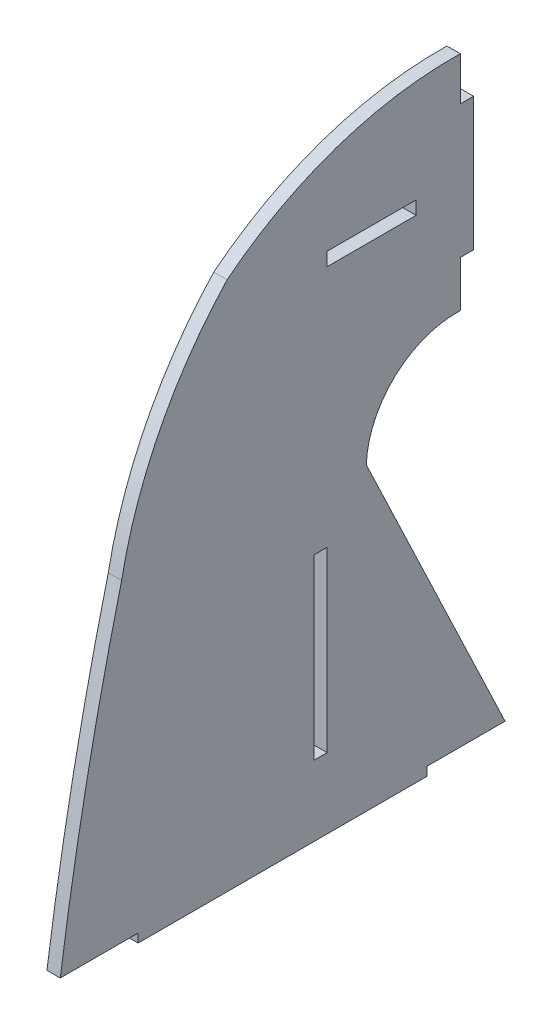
ISO-10303-21;
HEADER;
FILE_DESCRIPTION(('STEP AP214'),'2;1');
FILE_NAME('part.step','',(''),(''),'','','');
FILE_SCHEMA(('AUTOMOTIVE_DESIGN { 1 0 10303 214 1 1 1 1 }'));
ENDSEC;
DATA;
#1=APPLICATION_CONTEXT('core data for automotive mechanical design processes');
#2=APPLICATION_PROTOCOL_DEFINITION('international standard','automotive_design',2000,#1);
#3=PRODUCT_CONTEXT('',#1,'mechanical');
#4=PRODUCT('Part','Part','',(#3));
#5=PRODUCT_RELATED_PRODUCT_CATEGORY('part','',(#4));
#6=PRODUCT_DEFINITION_FORMATION('','',#4);
#7=PRODUCT_DEFINITION_CONTEXT('part definition',#1,'design');
#8=PRODUCT_DEFINITION('design','',#6,#7);
#9=PRODUCT_DEFINITION_SHAPE('','',#8);
#10=(LENGTH_UNIT() NAMED_UNIT(*) SI_UNIT(.MILLI.,.METRE.));
#11=(NAMED_UNIT(*) PLANE_ANGLE_UNIT() SI_UNIT($,.RADIAN.));
#12=(NAMED_UNIT(*) SI_UNIT($,.STERADIAN.) SOLID_ANGLE_UNIT());
#13=UNCERTAINTY_MEASURE_WITH_UNIT(LENGTH_MEASURE(1.E-05),#10,'distance_accuracy_value','');
#14=(GEOMETRIC_REPRESENTATION_CONTEXT(3) GLOBAL_UNCERTAINTY_ASSIGNED_CONTEXT((#13)) GLOBAL_UNIT_ASSIGNED_CONTEXT((#10,
#11,#12)) REPRESENTATION_CONTEXT('',''));
#15=CARTESIAN_POINT('',(0.,0.,0.));
#16=DIRECTION('',(0.,0.,1.));
#17=DIRECTION('',(1.,0.,0.));
#18=AXIS2_PLACEMENT_3D('',#15,#16,#17);
#19=CARTESIAN_POINT('',(3.,-123.619326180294,0.));
#20=DIRECTION('',(0.,-1.,0.));
#21=DIRECTION('',(0.,0.,-1.));
#22=AXIS2_PLACEMENT_3D('',#19,#20,#21);
#23=PLANE('',#22);
#24=DIRECTION('',(0.,0.,1.));
#25=VECTOR('',#24,1.);
#26=CARTESIAN_POINT('',(0.,-123.619326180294,0.));
#27=LINE('',#26,#25);
#28=CARTESIAN_POINT('',(0.,-123.619326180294,-10.));
#29=VERTEX_POINT('',#28);
#30=CARTESIAN_POINT('',(0.,-123.619326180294,-7.));
#31=VERTEX_POINT('',#30);
#32=EDGE_CURVE('E272',#29,#31,#27,.T.);
#33=ORIENTED_EDGE('',*,*,#32,.T.);
#34=DIRECTION('',(-1.,0.,0.));
#35=VECTOR('',#34,1.);
#36=CARTESIAN_POINT('',(3.,-123.619326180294,-7.));
#37=LINE('',#36,#35);
#38=CARTESIAN_POINT('',(3.,-123.619326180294,-7.));
#39=VERTEX_POINT('',#38);
#40=EDGE_CURVE('E11',#39,#31,#37,.T.);
#41=ORIENTED_EDGE('',*,*,#40,.F.);
#42=DIRECTION('',(0.,0.,1.));
#43=VECTOR('',#42,1.);
#44=CARTESIAN_POINT('',(3.,-123.619326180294,0.));
#45=LINE('',#44,#43);
#46=CARTESIAN_POINT('',(3.,-123.619326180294,-10.));
#47=VERTEX_POINT('',#46);
#48=EDGE_CURVE('E204',#47,#39,#45,.T.);
#49=ORIENTED_EDGE('',*,*,#48,.F.);
#50=DIRECTION('',(-1.,0.,0.));
#51=VECTOR('',#50,1.);
#52=CARTESIAN_POINT('',(3.,-123.619326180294,-10.));
#53=LINE('',#52,#51);
#54=EDGE_CURVE('E54',#47,#29,#53,.T.);
#55=ORIENTED_EDGE('',*,*,#54,.T.);
#56=EDGE_LOOP('',(#33,#41,#49,#55));
#57=FACE_BOUND('',#56,.T.);
#58=ADVANCED_FACE('F35',(#57),#23,.F.);
#59=CARTESIAN_POINT('',(3.,0.,-7.));
#60=DIRECTION('',(0.,0.,1.));
#61=DIRECTION('',(1.,0.,0.));
#62=AXIS2_PLACEMENT_3D('',#59,#60,#61);
#63=PLANE('',#62);
#64=DIRECTION('',(0.,1.,0.));
#65=VECTOR('',#64,1.);
#66=CARTESIAN_POINT('',(0.,0.,-7.));
#67=LINE('',#66,#65);
#68=CARTESIAN_POINT('',(0.,-83.6193261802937,-7.));
#69=VERTEX_POINT('',#68);
#70=EDGE_CURVE('E210',#31,#69,#67,.T.);
#71=ORIENTED_EDGE('',*,*,#70,.T.);
#72=DIRECTION('',(-1.,0.,0.));
#73=VECTOR('',#72,1.);
#74=CARTESIAN_POINT('',(3.,-83.6193261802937,-7.));
#75=LINE('',#74,#73);
#76=CARTESIAN_POINT('',(3.,-83.6193261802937,-7.));
#77=VERTEX_POINT('',#76);
#78=EDGE_CURVE('E45',#77,#69,#75,.T.);
#79=ORIENTED_EDGE('',*,*,#78,.F.);
#80=DIRECTION('',(0.,1.,0.));
#81=VECTOR('',#80,1.);
#82=CARTESIAN_POINT('',(3.,0.,-7.));
#83=LINE('',#82,#81);
#84=EDGE_CURVE('E198',#39,#77,#83,.T.);
#85=ORIENTED_EDGE('',*,*,#84,.F.);
#86=ORIENTED_EDGE('',*,*,#40,.T.);
#87=EDGE_LOOP('',(#71,#79,#85,#86));
#88=FACE_BOUND('',#87,.T.);
#89=ADVANCED_FACE('F209',(#88),#63,.F.);
#90=CARTESIAN_POINT('',(3.,-83.6193261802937,0.));
#91=DIRECTION('',(0.,-1.,0.));
#92=DIRECTION('',(0.,0.,-1.));
#93=AXIS2_PLACEMENT_3D('',#90,#91,#92);
#94=PLANE('',#93);
#95=DIRECTION('',(0.,0.,1.));
#96=VECTOR('',#95,1.);
#97=CARTESIAN_POINT('',(0.,-83.6193261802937,0.));
#98=LINE('',#97,#96);
#99=CARTESIAN_POINT('',(0.,-83.6193261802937,-10.));
#100=VERTEX_POINT('',#99);
#101=EDGE_CURVE('E275',#100,#69,#98,.T.);
#102=ORIENTED_EDGE('',*,*,#101,.F.);
#103=DIRECTION('',(-1.,0.,0.));
#104=VECTOR('',#103,1.);
#105=CARTESIAN_POINT('',(3.,-83.6193261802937,-10.));
#106=LINE('',#105,#104);
#107=CARTESIAN_POINT('',(3.,-83.6193261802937,-10.));
#108=VERTEX_POINT('',#107);
#109=EDGE_CURVE('E125',#108,#100,#106,.T.);
#110=ORIENTED_EDGE('',*,*,#109,.F.);
#111=DIRECTION('',(0.,0.,1.));
#112=VECTOR('',#111,1.);
#113=CARTESIAN_POINT('',(3.,-83.6193261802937,0.));
#114=LINE('',#113,#112);
#115=EDGE_CURVE('E203',#108,#77,#114,.T.);
#116=ORIENTED_EDGE('',*,*,#115,.T.);
#117=ORIENTED_EDGE('',*,*,#78,.T.);
#118=EDGE_LOOP('',(#102,#110,#116,#117));
#119=FACE_BOUND('',#118,.T.);
#120=ADVANCED_FACE('F214',(#119),#94,.T.);
#121=CARTESIAN_POINT('',(3.,-26.,0.));
#122=DIRECTION('',(0.,1.,0.));
#123=DIRECTION('',(0.,0.,1.));
#124=AXIS2_PLACEMENT_3D('',#121,#122,#123);
#125=PLANE('',#124);
#126=DIRECTION('',(0.,0.,-1.));
#127=VECTOR('',#126,1.);
#128=CARTESIAN_POINT('',(0.,-26.,0.));
#129=LINE('',#128,#127);
#130=CARTESIAN_POINT('',(0.,-26.,-10.));
#131=VERTEX_POINT('',#130);
#132=CARTESIAN_POINT('',(0.,-26.,-30.));
#133=VERTEX_POINT('',#132);
#134=EDGE_CURVE('E260',#131,#133,#129,.T.);
#135=ORIENTED_EDGE('',*,*,#134,.T.);
#136=DIRECTION('',(-1.,0.,0.));
#137=VECTOR('',#136,1.);
#138=CARTESIAN_POINT('',(3.,-26.,-30.));
#139=LINE('',#138,#137);
#140=CARTESIAN_POINT('',(3.,-26.,-30.));
#141=VERTEX_POINT('',#140);
#142=EDGE_CURVE('E282',#141,#133,#139,.T.);
#143=ORIENTED_EDGE('',*,*,#142,.F.);
#144=DIRECTION('',(0.,0.,-1.));
#145=VECTOR('',#144,1.);
#146=CARTESIAN_POINT('',(3.,-26.,0.));
#147=LINE('',#146,#145);
#148=CARTESIAN_POINT('',(3.,-26.,-10.));
#149=VERTEX_POINT('',#148);
#150=EDGE_CURVE('E425',#149,#141,#147,.T.);
#151=ORIENTED_EDGE('',*,*,#150,.F.);
#152=DIRECTION('',(-1.,0.,0.));
#153=VECTOR('',#152,1.);
#154=CARTESIAN_POINT('',(3.,-26.,-10.));
#155=LINE('',#154,#153);
#156=EDGE_CURVE('E284',#149,#131,#155,.T.);
#157=ORIENTED_EDGE('',*,*,#156,.T.);
#158=EDGE_LOOP('',(#135,#143,#151,#157));
#159=FACE_BOUND('',#158,.T.);
#160=ADVANCED_FACE('F450',(#159),#125,.F.);
#161=CARTESIAN_POINT('',(3.,0.,-30.));
#162=DIRECTION('',(0.,0.,-1.));
#163=DIRECTION('',(-1.,0.,0.));
#164=AXIS2_PLACEMENT_3D('',#161,#162,#163);
#165=PLANE('',#164);
#166=DIRECTION('',(0.,-1.,0.));
#167=VECTOR('',#166,1.);
#168=CARTESIAN_POINT('',(0.,0.,-30.));
#169=LINE('',#168,#167);
#170=CARTESIAN_POINT('',(0.,-29.,-30.));
#171=VERTEX_POINT('',#170);
#172=EDGE_CURVE('E263',#133,#171,#169,.T.);
#173=ORIENTED_EDGE('',*,*,#172,.T.);
#174=DIRECTION('',(-1.,0.,0.));
#175=VECTOR('',#174,1.);
#176=CARTESIAN_POINT('',(3.,-29.,-30.));
#177=LINE('',#176,#175);
#178=CARTESIAN_POINT('',(3.,-29.,-30.));
#179=VERTEX_POINT('',#178);
#180=EDGE_CURVE('E288',#179,#171,#177,.T.);
#181=ORIENTED_EDGE('',*,*,#180,.F.);
#182=DIRECTION('',(0.,-1.,0.));
#183=VECTOR('',#182,1.);
#184=CARTESIAN_POINT('',(3.,0.,-30.));
#185=LINE('',#184,#183);
#186=EDGE_CURVE('E428',#141,#179,#185,.T.);
#187=ORIENTED_EDGE('',*,*,#186,.F.);
#188=ORIENTED_EDGE('',*,*,#142,.T.);
#189=EDGE_LOOP('',(#173,#181,#187,#188));
#190=FACE_BOUND('',#189,.T.);
#191=ADVANCED_FACE('F452',(#190),#165,.F.);
#192=CARTESIAN_POINT('',(3.,-29.,0.));
#193=DIRECTION('',(0.,1.,0.));
#194=DIRECTION('',(0.,0.,1.));
#195=AXIS2_PLACEMENT_3D('',#192,#193,#194);
#196=PLANE('',#195);
#197=DIRECTION('',(0.,0.,-1.));
#198=VECTOR('',#197,1.);
#199=CARTESIAN_POINT('',(0.,-29.,0.));
#200=LINE('',#199,#198);
#201=CARTESIAN_POINT('',(0.,-29.,-10.));
#202=VERTEX_POINT('',#201);
#203=EDGE_CURVE('E266',#202,#171,#200,.T.);
#204=ORIENTED_EDGE('',*,*,#203,.F.);
#205=DIRECTION('',(-1.,0.,0.));
#206=VECTOR('',#205,1.);
#207=CARTESIAN_POINT('',(3.,-29.,-10.));
#208=LINE('',#207,#206);
#209=CARTESIAN_POINT('',(3.,-29.,-10.));
#210=VERTEX_POINT('',#209);
#211=EDGE_CURVE('E286',#210,#202,#208,.T.);
#212=ORIENTED_EDGE('',*,*,#211,.F.);
#213=DIRECTION('',(0.,0.,-1.));
#214=VECTOR('',#213,1.);
#215=CARTESIAN_POINT('',(3.,-29.,0.));
#216=LINE('',#215,#214);
#217=EDGE_CURVE('E430',#210,#179,#216,.T.);
#218=ORIENTED_EDGE('',*,*,#217,.T.);
#219=ORIENTED_EDGE('',*,*,#180,.T.);
#220=EDGE_LOOP('',(#204,#212,#218,#219));
#221=FACE_BOUND('',#220,.T.);
#222=ADVANCED_FACE('F446',(#221),#196,.T.);
#223=CARTESIAN_POINT('',(3.,-72.8176423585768,-39.0635127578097));
#224=DIRECTION('',(-1.,0.,0.));
#225=DIRECTION('',(0.,0.,1.));
#226=AXIS2_PLACEMENT_3D('',#223,#224,#225);
#227=CYLINDRICAL_SURFACE('',#226,20.2971132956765);
#228=CARTESIAN_POINT('',(0.,-72.8176423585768,-39.0635127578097));
#229=DIRECTION('',(1.,0.,0.));
#230=DIRECTION('',(0.,0.,-1.));
#231=AXIS2_PLACEMENT_3D('',#228,#229,#230);
#232=CIRCLE('',#231,20.2971132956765);
#233=CARTESIAN_POINT('',(0.,-52.5391449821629,-39.9326228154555));
#234=VERTEX_POINT('',#233);
#235=CARTESIAN_POINT('',(0.,-71.9485323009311,-18.7850153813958));
#236=VERTEX_POINT('',#235);
#237=EDGE_CURVE('E221',#234,#236,#232,.T.);
#238=ORIENTED_EDGE('',*,*,#237,.F.);
#239=DIRECTION('',(-1.,0.,0.));
#240=VECTOR('',#239,1.);
#241=CARTESIAN_POINT('',(3.,-52.5391449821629,-39.9326228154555));
#242=LINE('',#241,#240);
#243=CARTESIAN_POINT('',(3.,-52.5391449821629,-39.9326228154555));
#244=VERTEX_POINT('',#243);
#245=EDGE_CURVE('E39',#244,#234,#242,.T.);
#246=ORIENTED_EDGE('',*,*,#245,.F.);
#247=CARTESIAN_POINT('',(3.,-72.8176423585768,-39.0635127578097));
#248=DIRECTION('',(1.,0.,0.));
#249=DIRECTION('',(0.,0.,-1.));
#250=AXIS2_PLACEMENT_3D('',#247,#248,#249);
#251=CIRCLE('',#250,20.2971132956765);
#252=CARTESIAN_POINT('',(3.,-71.9485323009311,-18.7850153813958));
#253=VERTEX_POINT('',#252);
#254=EDGE_CURVE('E280',#244,#253,#251,.T.);
#255=ORIENTED_EDGE('',*,*,#254,.T.);
#256=DIRECTION('',(-1.,0.,0.));
#257=VECTOR('',#256,1.);
#258=CARTESIAN_POINT('',(3.,-71.9485323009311,-18.7850153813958));
#259=LINE('',#258,#257);
#260=EDGE_CURVE('E217',#253,#236,#259,.T.);
#261=ORIENTED_EDGE('',*,*,#260,.T.);
#262=EDGE_LOOP('',(#238,#246,#255,#261));
#263=FACE_BOUND('',#262,.T.);
#264=ADVANCED_FACE('F37',(#263),#227,.F.);
#265=CARTESIAN_POINT('',(3.,0.,-39.9326228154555));
#266=DIRECTION('',(0.,0.,1.));
#267=DIRECTION('',(1.,0.,0.));
#268=AXIS2_PLACEMENT_3D('',#265,#266,#267);
#269=PLANE('',#268);
#270=DIRECTION('',(0.,1.,0.));
#271=VECTOR('',#270,1.);
#272=CARTESIAN_POINT('',(0.,0.,-39.9326228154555));
#273=LINE('',#272,#271);
#274=CARTESIAN_POINT('',(0.,-42.1755134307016,-39.9326228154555));
#275=VERTEX_POINT('',#274);
#276=EDGE_CURVE('E224',#234,#275,#273,.T.);
#277=ORIENTED_EDGE('',*,*,#276,.T.);
#278=DIRECTION('',(-1.,0.,0.));
#279=VECTOR('',#278,1.);
#280=CARTESIAN_POINT('',(3.,-42.1755134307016,-39.9326228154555));
#281=LINE('',#280,#279);
#282=CARTESIAN_POINT('',(3.,-42.1755134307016,-39.9326228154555));
#283=VERTEX_POINT('',#282);
#284=EDGE_CURVE('E321',#283,#275,#281,.T.);
#285=ORIENTED_EDGE('',*,*,#284,.F.);
#286=DIRECTION('',(0.,1.,0.));
#287=VECTOR('',#286,1.);
#288=CARTESIAN_POINT('',(3.,0.,-39.9326228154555));
#289=LINE('',#288,#287);
#290=EDGE_CURVE('E330',#244,#283,#289,.T.);
#291=ORIENTED_EDGE('',*,*,#290,.F.);
#292=ORIENTED_EDGE('',*,*,#245,.T.);
#293=EDGE_LOOP('',(#277,#285,#291,#292));
#294=FACE_BOUND('',#293,.T.);
#295=ADVANCED_FACE('F329',(#294),#269,.F.);
#296=CARTESIAN_POINT('',(3.,-42.1755134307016,0.));
#297=DIRECTION('',(0.,1.,0.));
#298=DIRECTION('',(0.,0.,1.));
#299=AXIS2_PLACEMENT_3D('',#296,#297,#298);
#300=PLANE('',#299);
#301=DIRECTION('',(0.,0.,-1.));
#302=VECTOR('',#301,1.);
#303=CARTESIAN_POINT('',(0.,-42.1755134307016,0.));
#304=LINE('',#303,#302);
#305=CARTESIAN_POINT('',(0.,-42.1755134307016,-42.9326228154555));
#306=VERTEX_POINT('',#305);
#307=EDGE_CURVE('E226',#275,#306,#304,.T.);
#308=ORIENTED_EDGE('',*,*,#307,.T.);
#309=DIRECTION('',(-1.,0.,0.));
#310=VECTOR('',#309,1.);
#311=CARTESIAN_POINT('',(3.,-42.1755134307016,-42.9326228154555));
#312=LINE('',#311,#310);
#313=CARTESIAN_POINT('',(3.,-42.1755134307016,-42.9326228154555));
#314=VERTEX_POINT('',#313);
#315=EDGE_CURVE('E319',#314,#306,#312,.T.);
#316=ORIENTED_EDGE('',*,*,#315,.F.);
#317=DIRECTION('',(0.,0.,-1.));
#318=VECTOR('',#317,1.);
#319=CARTESIAN_POINT('',(3.,-42.1755134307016,0.));
#320=LINE('',#319,#318);
#321=EDGE_CURVE('E403',#283,#314,#320,.T.);
#322=ORIENTED_EDGE('',*,*,#321,.F.);
#323=ORIENTED_EDGE('',*,*,#284,.T.);
#324=EDGE_LOOP('',(#308,#316,#322,#323));
#325=FACE_BOUND('',#324,.T.);
#326=ADVANCED_FACE('F402',(#325),#300,.F.);
#327=CARTESIAN_POINT('',(3.,0.,-42.9326228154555));
#328=DIRECTION('',(0.,0.,1.));
#329=DIRECTION('',(1.,0.,0.));
#330=AXIS2_PLACEMENT_3D('',#327,#328,#329);
#331=PLANE('',#330);
#332=DIRECTION('',(0.,1.,0.));
#333=VECTOR('',#332,1.);
#334=CARTESIAN_POINT('',(0.,0.,-42.9326228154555));
#335=LINE('',#334,#333);
#336=CARTESIAN_POINT('',(0.,-12.2755134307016,-42.9326228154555));
#337=VERTEX_POINT('',#336);
#338=EDGE_CURVE('E228',#306,#337,#335,.T.);
#339=ORIENTED_EDGE('',*,*,#338,.T.);
#340=DIRECTION('',(-1.,0.,0.));
#341=VECTOR('',#340,1.);
#342=CARTESIAN_POINT('',(3.,-12.2755134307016,-42.9326228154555));
#343=LINE('',#342,#341);
#344=CARTESIAN_POINT('',(3.,-12.2755134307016,-42.9326228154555));
#345=VERTEX_POINT('',#344);
#346=EDGE_CURVE('E317',#345,#337,#343,.T.);
#347=ORIENTED_EDGE('',*,*,#346,.F.);
#348=DIRECTION('',(0.,1.,0.));
#349=VECTOR('',#348,1.);
#350=CARTESIAN_POINT('',(3.,0.,-42.9326228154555));
#351=LINE('',#350,#349);
#352=EDGE_CURVE('E401',#314,#345,#351,.T.);
#353=ORIENTED_EDGE('',*,*,#352,.F.);
#354=ORIENTED_EDGE('',*,*,#315,.T.);
#355=EDGE_LOOP('',(#339,#347,#353,#354));
#356=FACE_BOUND('',#355,.T.);
#357=ADVANCED_FACE('F399',(#356),#331,.F.);
#358=CARTESIAN_POINT('',(3.,-12.2755134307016,0.));
#359=DIRECTION('',(0.,1.,0.));
#360=DIRECTION('',(0.,0.,1.));
#361=AXIS2_PLACEMENT_3D('',#358,#359,#360);
#362=PLANE('',#361);
#363=DIRECTION('',(0.,0.,-1.));
#364=VECTOR('',#363,1.);
#365=CARTESIAN_POINT('',(0.,-12.2755134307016,0.));
#366=LINE('',#365,#364);
#367=CARTESIAN_POINT('',(0.,-12.2755134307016,-39.9326228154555));
#368=VERTEX_POINT('',#367);
#369=EDGE_CURVE('E231',#368,#337,#366,.T.);
#370=ORIENTED_EDGE('',*,*,#369,.F.);
#371=DIRECTION('',(-1.,0.,0.));
#372=VECTOR('',#371,1.);
#373=CARTESIAN_POINT('',(3.,-12.2755134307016,-39.9326228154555));
#374=LINE('',#373,#372);
#375=CARTESIAN_POINT('',(3.,-12.2755134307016,-39.9326228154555));
#376=VERTEX_POINT('',#375);
#377=EDGE_CURVE('E315',#376,#368,#374,.T.);
#378=ORIENTED_EDGE('',*,*,#377,.F.);
#379=DIRECTION('',(0.,0.,-1.));
#380=VECTOR('',#379,1.);
#381=CARTESIAN_POINT('',(3.,-12.2755134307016,0.));
#382=LINE('',#381,#380);
#383=EDGE_CURVE('E396',#376,#345,#382,.T.);
#384=ORIENTED_EDGE('',*,*,#383,.T.);
#385=ORIENTED_EDGE('',*,*,#346,.T.);
#386=EDGE_LOOP('',(#370,#378,#384,#385));
#387=FACE_BOUND('',#386,.T.);
#388=ADVANCED_FACE('F391',(#387),#362,.T.);
#389=CARTESIAN_POINT('',(3.,0.,-39.9326228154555));
#390=DIRECTION('',(0.,0.,1.));
#391=DIRECTION('',(0.,-1.,0.));
#392=AXIS2_PLACEMENT_3D('',#389,#390,#391);
#393=PLANE('',#392);
#394=DIRECTION('',(0.,1.,0.));
#395=VECTOR('',#394,1.);
#396=CARTESIAN_POINT('',(0.,0.,-39.9326228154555));
#397=LINE('',#396,#395);
#398=CARTESIAN_POINT('',(0.,-2.50000000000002,-39.9326228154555));
#399=VERTEX_POINT('',#398);
#400=EDGE_CURVE('E234',#368,#399,#397,.T.);
#401=ORIENTED_EDGE('',*,*,#400,.T.);
#402=DIRECTION('',(-1.,0.,0.));
#403=VECTOR('',#402,1.);
#404=CARTESIAN_POINT('',(3.,-2.50000000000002,-39.9326228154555));
#405=LINE('',#404,#403);
#406=CARTESIAN_POINT('',(3.,-2.50000000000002,-39.9326228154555));
#407=VERTEX_POINT('',#406);
#408=EDGE_CURVE('E312',#407,#399,#405,.T.);
#409=ORIENTED_EDGE('',*,*,#408,.F.);
#410=DIRECTION('',(0.,1.,0.));
#411=VECTOR('',#410,1.);
#412=CARTESIAN_POINT('',(3.,0.,-39.9326228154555));
#413=LINE('',#412,#411);
#414=EDGE_CURVE('E411',#376,#407,#413,.T.);
#415=ORIENTED_EDGE('',*,*,#414,.F.);
#416=ORIENTED_EDGE('',*,*,#377,.T.);
#417=EDGE_LOOP('',(#401,#409,#415,#416));
#418=FACE_BOUND('',#417,.T.);
#419=ADVANCED_FACE('F495',(#418),#393,.F.);
#420=CARTESIAN_POINT('',(3.,-84.19117621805,-38.4282214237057));
#421=DIRECTION('',(-1.,0.,0.));
#422=DIRECTION('',(0.,0.,1.));
#423=AXIS2_PLACEMENT_3D('',#420,#421,#422);
#424=CYLINDRICAL_SURFACE('',#423,81.7050273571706);
#425=CARTESIAN_POINT('',(0.,-84.19117621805,-38.4282214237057));
#426=DIRECTION('',(1.,0.,0.));
#427=DIRECTION('',(0.,0.,-1.));
#428=AXIS2_PLACEMENT_3D('',#425,#426,#427);
#429=CIRCLE('',#428,81.7050273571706);
#430=CARTESIAN_POINT('',(0.,-20.2909224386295,12.4880732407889));
#431=VERTEX_POINT('',#430);
#432=EDGE_CURVE('E236',#399,#431,#429,.T.);
#433=ORIENTED_EDGE('',*,*,#432,.T.);
#434=DIRECTION('',(-1.,0.,0.));
#435=VECTOR('',#434,1.);
#436=CARTESIAN_POINT('',(3.,-20.2909224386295,12.4880732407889));
#437=LINE('',#436,#435);
#438=CARTESIAN_POINT('',(3.,-20.2909224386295,12.4880732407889));
#439=VERTEX_POINT('',#438);
#440=EDGE_CURVE('E310',#439,#431,#437,.T.);
#441=ORIENTED_EDGE('',*,*,#440,.F.);
#442=CARTESIAN_POINT('',(3.,-84.19117621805,-38.4282214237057));
#443=DIRECTION('',(1.,0.,0.));
#444=DIRECTION('',(0.,0.,-1.));
#445=AXIS2_PLACEMENT_3D('',#442,#443,#444);
#446=CIRCLE('',#445,81.7050273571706);
#447=EDGE_CURVE('E413',#407,#439,#446,.T.);
#448=ORIENTED_EDGE('',*,*,#447,.F.);
#449=ORIENTED_EDGE('',*,*,#408,.T.);
#450=EDGE_LOOP('',(#433,#441,#448,#449));
#451=FACE_BOUND('',#450,.T.);
#452=ADVANCED_FACE('F385',(#451),#424,.T.);
#453=CARTESIAN_POINT('',(3.,-85.0415719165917,-57.1585149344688));
#454=DIRECTION('',(-1.,0.,0.));
#455=DIRECTION('',(0.,0.,1.));
#456=AXIS2_PLACEMENT_3D('',#453,#454,#455);
#457=CYLINDRICAL_SURFACE('',#456,95.0962346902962);
#458=CARTESIAN_POINT('',(0.,-85.0415719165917,-57.1585149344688));
#459=DIRECTION('',(1.,0.,0.));
#460=DIRECTION('',(0.,0.,-1.));
#461=AXIS2_PLACEMENT_3D('',#458,#459,#460);
#462=CIRCLE('',#461,95.0962346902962);
#463=CARTESIAN_POINT('',(0.,-67.0138741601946,36.213300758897));
#464=VERTEX_POINT('',#463);
#465=EDGE_CURVE('E239',#464,#431,#462,.F.);
#466=ORIENTED_EDGE('',*,*,#465,.F.);
#467=DIRECTION('',(-1.,0.,0.));
#468=VECTOR('',#467,1.);
#469=CARTESIAN_POINT('',(3.,-67.0138741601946,36.213300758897));
#470=LINE('',#469,#468);
#471=CARTESIAN_POINT('',(3.,-67.0138741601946,36.213300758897));
#472=VERTEX_POINT('',#471);
#473=EDGE_CURVE('E308',#472,#464,#470,.T.);
#474=ORIENTED_EDGE('',*,*,#473,.F.);
#475=CARTESIAN_POINT('',(3.,-85.0415719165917,-57.1585149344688));
#476=DIRECTION('',(1.,0.,0.));
#477=DIRECTION('',(0.,0.,-1.));
#478=AXIS2_PLACEMENT_3D('',#475,#476,#477);
#479=CIRCLE('',#478,95.0962346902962);
#480=EDGE_CURVE('E382',#472,#439,#479,.F.);
#481=ORIENTED_EDGE('',*,*,#480,.T.);
#482=ORIENTED_EDGE('',*,*,#440,.T.);
#483=EDGE_LOOP('',(#466,#474,#481,#482));
#484=FACE_BOUND('',#483,.T.);
#485=ADVANCED_FACE('F379',(#484),#457,.T.);
#486=CARTESIAN_POINT('',(3.,-232.588255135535,-623.227584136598));
#487=DIRECTION('',(-1.,0.,0.));
#488=DIRECTION('',(0.,0.,1.));
#489=AXIS2_PLACEMENT_3D('',#486,#487,#488);
#490=CYLINDRICAL_SURFACE('',#489,679.909667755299);
#491=CARTESIAN_POINT('',(0.,-232.588255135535,-623.227584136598));
#492=DIRECTION('',(1.,0.,0.));
#493=DIRECTION('',(0.,0.,-1.));
#494=AXIS2_PLACEMENT_3D('',#491,#492,#493);
#495=CIRCLE('',#494,679.909667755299);
#496=CARTESIAN_POINT('',(0.,-137.5,50.));
#497=VERTEX_POINT('',#496);
#498=EDGE_CURVE('E242',#464,#497,#495,.T.);
#499=ORIENTED_EDGE('',*,*,#498,.T.);
#500=DIRECTION('',(-1.,0.,0.));
#501=VECTOR('',#500,1.);
#502=CARTESIAN_POINT('',(3.,-137.5,50.));
#503=LINE('',#502,#501);
#504=CARTESIAN_POINT('',(3.,-137.5,50.));
#505=VERTEX_POINT('',#504);
#506=EDGE_CURVE('E305',#505,#497,#503,.T.);
#507=ORIENTED_EDGE('',*,*,#506,.F.);
#508=CARTESIAN_POINT('',(3.,-232.588255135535,-623.227584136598));
#509=DIRECTION('',(1.,0.,0.));
#510=DIRECTION('',(0.,0.,-1.));
#511=AXIS2_PLACEMENT_3D('',#508,#509,#510);
#512=CIRCLE('',#511,679.909667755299);
#513=EDGE_CURVE('E374',#472,#505,#512,.T.);
#514=ORIENTED_EDGE('',*,*,#513,.F.);
#515=ORIENTED_EDGE('',*,*,#473,.T.);
#516=EDGE_LOOP('',(#499,#507,#514,#515));
#517=FACE_BOUND('',#516,.T.);
#518=ADVANCED_FACE('F373',(#517),#490,.T.);
#519=CARTESIAN_POINT('',(3.,-137.5,0.));
#520=DIRECTION('',(0.,1.,0.));
#521=DIRECTION('',(0.,0.,1.));
#522=AXIS2_PLACEMENT_3D('',#519,#520,#521);
#523=PLANE('',#522);
#524=DIRECTION('',(0.,0.,-1.));
#525=VECTOR('',#524,1.);
#526=CARTESIAN_POINT('',(0.,-137.5,0.));
#527=LINE('',#526,#525);
#528=CARTESIAN_POINT('',(0.,-137.5,32.5));
#529=VERTEX_POINT('',#528);
#530=EDGE_CURVE('E244',#497,#529,#527,.T.);
#531=ORIENTED_EDGE('',*,*,#530,.T.);
#532=DIRECTION('',(-1.,0.,0.));
#533=VECTOR('',#532,1.);
#534=CARTESIAN_POINT('',(3.,-137.5,32.5));
#535=LINE('',#534,#533);
#536=CARTESIAN_POINT('',(3.,-137.5,32.5));
#537=VERTEX_POINT('',#536);
#538=EDGE_CURVE('E302',#537,#529,#535,.T.);
#539=ORIENTED_EDGE('',*,*,#538,.F.);
#540=DIRECTION('',(0.,0.,-1.));
#541=VECTOR('',#540,1.);
#542=CARTESIAN_POINT('',(3.,-137.5,0.));
#543=LINE('',#542,#541);
#544=EDGE_CURVE('E369',#505,#537,#543,.T.);
#545=ORIENTED_EDGE('',*,*,#544,.F.);
#546=ORIENTED_EDGE('',*,*,#506,.T.);
#547=EDGE_LOOP('',(#531,#539,#545,#546));
#548=FACE_BOUND('',#547,.T.);
#549=ADVANCED_FACE('F368',(#548),#523,.F.);
#550=CARTESIAN_POINT('',(3.,1.15308836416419E-13,32.4999999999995));
#551=DIRECTION('',(0.,0.,-1.));
#552=DIRECTION('',(0.,1.,0.));
#553=AXIS2_PLACEMENT_3D('',#550,#551,#552);
#554=PLANE('',#553);
#555=DIRECTION('',(0.,-1.,0.));
#556=VECTOR('',#555,1.);
#557=CARTESIAN_POINT('',(0.,1.15308836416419E-13,32.4999999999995));
#558=LINE('',#557,#556);
#559=CARTESIAN_POINT('',(0.,-139.455739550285,32.5));
#560=VERTEX_POINT('',#559);
#561=EDGE_CURVE('E246',#529,#560,#558,.T.);
#562=ORIENTED_EDGE('',*,*,#561,.T.);
#563=DIRECTION('',(-1.,0.,0.));
#564=VECTOR('',#563,1.);
#565=CARTESIAN_POINT('',(3.,-139.455739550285,32.5));
#566=LINE('',#565,#564);
#567=CARTESIAN_POINT('',(3.,-139.455739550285,32.5));
#568=VERTEX_POINT('',#567);
#569=EDGE_CURVE('E299',#568,#560,#566,.T.);
#570=ORIENTED_EDGE('',*,*,#569,.F.);
#571=DIRECTION('',(0.,-1.,0.));
#572=VECTOR('',#571,1.);
#573=CARTESIAN_POINT('',(3.,1.15308836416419E-13,32.4999999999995));
#574=LINE('',#573,#572);
#575=EDGE_CURVE('E365',#537,#568,#574,.T.);
#576=ORIENTED_EDGE('',*,*,#575,.F.);
#577=ORIENTED_EDGE('',*,*,#538,.T.);
#578=EDGE_LOOP('',(#562,#570,#576,#577));
#579=FACE_BOUND('',#578,.T.);
#580=ADVANCED_FACE('F362',(#579),#554,.F.);
#581=CARTESIAN_POINT('',(3.,-139.455739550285,0.));
#582=DIRECTION('',(0.,1.,0.));
#583=DIRECTION('',(0.,0.,1.));
#584=AXIS2_PLACEMENT_3D('',#581,#582,#583);
#585=PLANE('',#584);
#586=DIRECTION('',(0.,0.,-1.));
#587=VECTOR('',#586,1.);
#588=CARTESIAN_POINT('',(0.,-139.455739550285,0.));
#589=LINE('',#588,#587);
#590=CARTESIAN_POINT('',(0.,-139.455739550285,-32.5));
#591=VERTEX_POINT('',#590);
#592=EDGE_CURVE('E248',#560,#591,#589,.T.);
#593=ORIENTED_EDGE('',*,*,#592,.T.);
#594=DIRECTION('',(-1.,0.,0.));
#595=VECTOR('',#594,1.);
#596=CARTESIAN_POINT('',(3.,-139.455739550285,-32.5));
#597=LINE('',#596,#595);
#598=CARTESIAN_POINT('',(3.,-139.455739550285,-32.5));
#599=VERTEX_POINT('',#598);
#600=EDGE_CURVE('E297',#599,#591,#597,.T.);
#601=ORIENTED_EDGE('',*,*,#600,.F.);
#602=DIRECTION('',(0.,0.,-1.));
#603=VECTOR('',#602,1.);
#604=CARTESIAN_POINT('',(3.,-139.455739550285,0.));
#605=LINE('',#604,#603);
#606=EDGE_CURVE('E419',#568,#599,#605,.T.);
#607=ORIENTED_EDGE('',*,*,#606,.F.);
#608=ORIENTED_EDGE('',*,*,#569,.T.);
#609=EDGE_LOOP('',(#593,#601,#607,#608));
#610=FACE_BOUND('',#609,.T.);
#611=ADVANCED_FACE('F356',(#610),#585,.F.);
#612=CARTESIAN_POINT('',(3.,0.,-32.5));
#613=DIRECTION('',(0.,0.,-1.));
#614=DIRECTION('',(-1.,0.,0.));
#615=AXIS2_PLACEMENT_3D('',#612,#613,#614);
#616=PLANE('',#615);
#617=DIRECTION('',(0.,-1.,0.));
#618=VECTOR('',#617,1.);
#619=CARTESIAN_POINT('',(0.,0.,-32.5));
#620=LINE('',#619,#618);
#621=CARTESIAN_POINT('',(0.,-137.5,-32.5));
#622=VERTEX_POINT('',#621);
#623=EDGE_CURVE('E251',#622,#591,#620,.T.);
#624=ORIENTED_EDGE('',*,*,#623,.F.);
#625=DIRECTION('',(-1.,0.,0.));
#626=VECTOR('',#625,1.);
#627=CARTESIAN_POINT('',(3.,-137.5,-32.5));
#628=LINE('',#627,#626);
#629=CARTESIAN_POINT('',(3.,-137.5,-32.5));
#630=VERTEX_POINT('',#629);
#631=EDGE_CURVE('E295',#630,#622,#628,.T.);
#632=ORIENTED_EDGE('',*,*,#631,.F.);
#633=DIRECTION('',(0.,-1.,0.));
#634=VECTOR('',#633,1.);
#635=CARTESIAN_POINT('',(3.,0.,-32.5));
#636=LINE('',#635,#634);
#637=EDGE_CURVE('E353',#630,#599,#636,.T.);
#638=ORIENTED_EDGE('',*,*,#637,.T.);
#639=ORIENTED_EDGE('',*,*,#600,.T.);
#640=EDGE_LOOP('',(#624,#632,#638,#639));
#641=FACE_BOUND('',#640,.T.);
#642=ADVANCED_FACE('F348',(#641),#616,.T.);
#643=CARTESIAN_POINT('',(3.,-137.5,0.));
#644=DIRECTION('',(0.,1.,0.));
#645=DIRECTION('',(0.,0.,1.));
#646=AXIS2_PLACEMENT_3D('',#643,#644,#645);
#647=PLANE('',#646);
#648=DIRECTION('',(0.,0.,-1.));
#649=VECTOR('',#648,1.);
#650=CARTESIAN_POINT('',(0.,-137.5,0.));
#651=LINE('',#650,#649);
#652=CARTESIAN_POINT('',(0.,-137.5,-50.));
#653=VERTEX_POINT('',#652);
#654=EDGE_CURVE('E254',#622,#653,#651,.T.);
#655=ORIENTED_EDGE('',*,*,#654,.T.);
#656=DIRECTION('',(-1.,0.,0.));
#657=VECTOR('',#656,1.);
#658=CARTESIAN_POINT('',(3.,-137.5,-50.));
#659=LINE('',#658,#657);
#660=CARTESIAN_POINT('',(3.,-137.5,-50.));
#661=VERTEX_POINT('',#660);
#662=EDGE_CURVE('E293',#661,#653,#659,.T.);
#663=ORIENTED_EDGE('',*,*,#662,.F.);
#664=DIRECTION('',(0.,0.,-1.));
#665=VECTOR('',#664,1.);
#666=CARTESIAN_POINT('',(3.,-137.5,0.));
#667=LINE('',#666,#665);
#668=EDGE_CURVE('E422',#630,#661,#667,.T.);
#669=ORIENTED_EDGE('',*,*,#668,.F.);
#670=ORIENTED_EDGE('',*,*,#631,.T.);
#671=EDGE_LOOP('',(#655,#663,#669,#670));
#672=FACE_BOUND('',#671,.T.);
#673=ADVANCED_FACE('F470',(#672),#647,.F.);
#674=CARTESIAN_POINT('',(3.,0.,-10.));
#675=DIRECTION('',(0.,0.,-1.));
#676=DIRECTION('',(-1.,0.,0.));
#677=AXIS2_PLACEMENT_3D('',#674,#675,#676);
#678=PLANE('',#677);
#679=DIRECTION('',(0.,-1.,0.));
#680=VECTOR('',#679,1.);
#681=CARTESIAN_POINT('',(0.,0.,-10.));
#682=LINE('',#681,#680);
#683=EDGE_CURVE('E269',#131,#202,#682,.T.);
#684=ORIENTED_EDGE('',*,*,#683,.F.);
#685=ORIENTED_EDGE('',*,*,#156,.F.);
#686=DIRECTION('',(0.,-1.,0.));
#687=VECTOR('',#686,1.);
#688=CARTESIAN_POINT('',(3.,0.,-10.));
#689=LINE('',#688,#687);
#690=EDGE_CURVE('E433',#149,#210,#689,.T.);
#691=ORIENTED_EDGE('',*,*,#690,.T.);
#692=ORIENTED_EDGE('',*,*,#211,.T.);
#693=EDGE_LOOP('',(#684,#685,#691,#692));
#694=FACE_BOUND('',#693,.T.);
#695=ADVANCED_FACE('F438',(#694),#678,.T.);
#696=CARTESIAN_POINT('',(3.,-6.00739371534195,12.6155268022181));
#697=DIRECTION('',(0.,0.429933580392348,-0.90286051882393));
#698=DIRECTION('',(0.,0.90286051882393,0.429933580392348));
#699=AXIS2_PLACEMENT_3D('',#696,#697,#698);
#700=PLANE('',#699);
#701=DIRECTION('',(0.,-0.90286051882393,-0.429933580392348));
#702=VECTOR('',#701,1.);
#703=CARTESIAN_POINT('',(0.,-6.00739371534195,12.6155268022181));
#704=LINE('',#703,#702);
#705=EDGE_CURVE('E257',#236,#653,#704,.T.);
#706=ORIENTED_EDGE('',*,*,#705,.F.);
#707=ORIENTED_EDGE('',*,*,#260,.F.);
#708=DIRECTION('',(0.,-0.90286051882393,-0.429933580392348));
#709=VECTOR('',#708,1.);
#710=CARTESIAN_POINT('',(3.,-6.00739371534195,12.6155268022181));
#711=LINE('',#710,#709);
#712=EDGE_CURVE('E341',#253,#661,#711,.T.);
#713=ORIENTED_EDGE('',*,*,#712,.T.);
#714=ORIENTED_EDGE('',*,*,#662,.T.);
#715=EDGE_LOOP('',(#706,#707,#713,#714));
#716=FACE_BOUND('',#715,.T.);
#717=ADVANCED_FACE('F340',(#716),#700,.T.);
#718=CARTESIAN_POINT('',(3.,0.,-10.));
#719=DIRECTION('',(0.,0.,1.));
#720=DIRECTION('',(0.,-1.,0.));
#721=AXIS2_PLACEMENT_3D('',#718,#719,#720);
#722=PLANE('',#721);
#723=DIRECTION('',(0.,1.,0.));
#724=VECTOR('',#723,1.);
#725=CARTESIAN_POINT('',(0.,0.,-10.));
#726=LINE('',#725,#724);
#727=EDGE_CURVE('E277',#29,#100,#726,.T.);
#728=ORIENTED_EDGE('',*,*,#727,.F.);
#729=ORIENTED_EDGE('',*,*,#54,.F.);
#730=DIRECTION('',(0.,1.,0.));
#731=VECTOR('',#730,1.);
#732=CARTESIAN_POINT('',(3.,0.,-10.));
#733=LINE('',#732,#731);
#734=EDGE_CURVE('E215',#47,#108,#733,.T.);
#735=ORIENTED_EDGE('',*,*,#734,.T.);
#736=ORIENTED_EDGE('',*,*,#109,.T.);
#737=EDGE_LOOP('',(#728,#729,#735,#736));
#738=FACE_BOUND('',#737,.T.);
#739=ADVANCED_FACE('F475',(#738),#722,.T.);
#740=CARTESIAN_POINT('',(3.,0.,0.));
#741=DIRECTION('',(1.,0.,0.));
#742=DIRECTION('',(0.,0.,-1.));
#743=AXIS2_PLACEMENT_3D('',#740,#741,#742);
#744=PLANE('',#743);
#745=ORIENTED_EDGE('',*,*,#254,.F.);
#746=ORIENTED_EDGE('',*,*,#290,.T.);
#747=ORIENTED_EDGE('',*,*,#321,.T.);
#748=ORIENTED_EDGE('',*,*,#352,.T.);
#749=ORIENTED_EDGE('',*,*,#383,.F.);
#750=ORIENTED_EDGE('',*,*,#414,.T.);
#751=ORIENTED_EDGE('',*,*,#447,.T.);
#752=ORIENTED_EDGE('',*,*,#480,.F.);
#753=ORIENTED_EDGE('',*,*,#513,.T.);
#754=ORIENTED_EDGE('',*,*,#544,.T.);
#755=ORIENTED_EDGE('',*,*,#575,.T.);
#756=ORIENTED_EDGE('',*,*,#606,.T.);
#757=ORIENTED_EDGE('',*,*,#637,.F.);
#758=ORIENTED_EDGE('',*,*,#668,.T.);
#759=ORIENTED_EDGE('',*,*,#712,.F.);
#760=EDGE_LOOP('',(#745,#746,#747,#748,#749,#750,#751,#752,#753,#754,#755,#756,#757,#758,#759));
#761=FACE_BOUND('',#760,.T.);
#762=ORIENTED_EDGE('',*,*,#150,.T.);
#763=ORIENTED_EDGE('',*,*,#186,.T.);
#764=ORIENTED_EDGE('',*,*,#217,.F.);
#765=ORIENTED_EDGE('',*,*,#690,.F.);
#766=EDGE_LOOP('',(#762,#763,#764,#765));
#767=FACE_BOUND('',#766,.T.);
#768=ORIENTED_EDGE('',*,*,#48,.T.);
#769=ORIENTED_EDGE('',*,*,#84,.T.);
#770=ORIENTED_EDGE('',*,*,#115,.F.);
#771=ORIENTED_EDGE('',*,*,#734,.F.);
#772=EDGE_LOOP('',(#768,#769,#770,#771));
#773=FACE_BOUND('',#772,.T.);
#774=ADVANCED_FACE('F200',(#761,#767,#773),#744,.T.);
#775=CARTESIAN_POINT('',(0.,0.,0.));
#776=DIRECTION('',(1.,0.,0.));
#777=DIRECTION('',(0.,0.,-1.));
#778=AXIS2_PLACEMENT_3D('',#775,#776,#777);
#779=PLANE('',#778);
#780=ORIENTED_EDGE('',*,*,#237,.T.);
#781=ORIENTED_EDGE('',*,*,#705,.T.);
#782=ORIENTED_EDGE('',*,*,#654,.F.);
#783=ORIENTED_EDGE('',*,*,#623,.T.);
#784=ORIENTED_EDGE('',*,*,#592,.F.);
#785=ORIENTED_EDGE('',*,*,#561,.F.);
#786=ORIENTED_EDGE('',*,*,#530,.F.);
#787=ORIENTED_EDGE('',*,*,#498,.F.);
#788=ORIENTED_EDGE('',*,*,#465,.T.);
#789=ORIENTED_EDGE('',*,*,#432,.F.);
#790=ORIENTED_EDGE('',*,*,#400,.F.);
#791=ORIENTED_EDGE('',*,*,#369,.T.);
#792=ORIENTED_EDGE('',*,*,#338,.F.);
#793=ORIENTED_EDGE('',*,*,#307,.F.);
#794=ORIENTED_EDGE('',*,*,#276,.F.);
#795=EDGE_LOOP('',(#780,#781,#782,#783,#784,#785,#786,#787,#788,#789,#790,#791,#792,#793,#794));
#796=FACE_BOUND('',#795,.T.);
#797=ORIENTED_EDGE('',*,*,#134,.F.);
#798=ORIENTED_EDGE('',*,*,#683,.T.);
#799=ORIENTED_EDGE('',*,*,#203,.T.);
#800=ORIENTED_EDGE('',*,*,#172,.F.);
#801=EDGE_LOOP('',(#797,#798,#799,#800));
#802=FACE_BOUND('',#801,.T.);
#803=ORIENTED_EDGE('',*,*,#32,.F.);
#804=ORIENTED_EDGE('',*,*,#727,.T.);
#805=ORIENTED_EDGE('',*,*,#101,.T.);
#806=ORIENTED_EDGE('',*,*,#70,.F.);
#807=EDGE_LOOP('',(#803,#804,#805,#806));
#808=FACE_BOUND('',#807,.T.);
#809=ADVANCED_FACE('F333',(#796,#802,#808),#779,.F.);
#810=CLOSED_SHELL('',(#58,#89,#120,#160,#191,#222,#264,#295,#326,#357,#388,#419,#452,#485,#518,
#549,#580,#611,#642,#673,#695,#717,#739,#774,#809));
#811=MANIFOLD_SOLID_BREP('B2',#810);
#812=ADVANCED_BREP_SHAPE_REPRESENTATION('',(#18,#811),#14);
#813=SHAPE_DEFINITION_REPRESENTATION(#9,#812);
ENDSEC;
END-ISO-10303-21;
